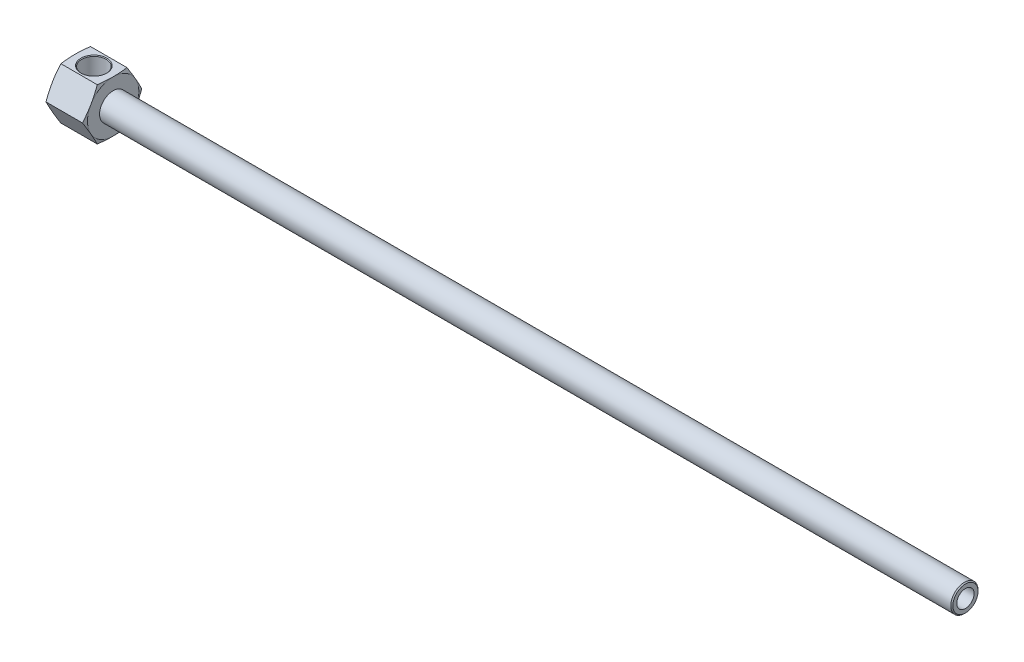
ISO-10303-21;
HEADER;
FILE_DESCRIPTION(('STEP AP214'),'2;1');
FILE_NAME('part.step','',(''),(''),'','','');
FILE_SCHEMA(('AUTOMOTIVE_DESIGN { 1 0 10303 214 1 1 1 1 }'));
ENDSEC;
DATA;
#1=APPLICATION_CONTEXT('core data for automotive mechanical design processes');
#2=APPLICATION_PROTOCOL_DEFINITION('international standard','automotive_design',2000,#1);
#3=PRODUCT_CONTEXT('',#1,'mechanical');
#4=PRODUCT('Part','Part','',(#3));
#5=PRODUCT_RELATED_PRODUCT_CATEGORY('part','',(#4));
#6=PRODUCT_DEFINITION_FORMATION('','',#4);
#7=PRODUCT_DEFINITION_CONTEXT('part definition',#1,'design');
#8=PRODUCT_DEFINITION('design','',#6,#7);
#9=PRODUCT_DEFINITION_SHAPE('','',#8);
#10=(LENGTH_UNIT() NAMED_UNIT(*) SI_UNIT(.MILLI.,.METRE.));
#11=(NAMED_UNIT(*) PLANE_ANGLE_UNIT() SI_UNIT($,.RADIAN.));
#12=(NAMED_UNIT(*) SI_UNIT($,.STERADIAN.) SOLID_ANGLE_UNIT());
#13=UNCERTAINTY_MEASURE_WITH_UNIT(LENGTH_MEASURE(1.E-05),#10,'distance_accuracy_value','');
#14=(GEOMETRIC_REPRESENTATION_CONTEXT(3) GLOBAL_UNCERTAINTY_ASSIGNED_CONTEXT((#13)) GLOBAL_UNIT_ASSIGNED_CONTEXT((#10,
#11,#12)) REPRESENTATION_CONTEXT('',''));
#15=CARTESIAN_POINT('',(0.,0.,0.));
#16=DIRECTION('',(0.,0.,1.));
#17=DIRECTION('',(1.,0.,0.));
#18=AXIS2_PLACEMENT_3D('',#15,#16,#17);
#19=CARTESIAN_POINT('',(0.,-9.525,9.63930330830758));
#20=DIRECTION('',(-1.,0.,0.));
#21=DIRECTION('',(0.,1.,0.));
#22=AXIS2_PLACEMENT_3D('',#19,#20,#21);
#23=PLANE('',#22);
#24=CARTESIAN_POINT('',(0.,0.,0.));
#25=DIRECTION('',(1.,0.,0.));
#26=DIRECTION('',(0.,0.,-1.));
#27=AXIS2_PLACEMENT_3D('',#24,#25,#26);
#28=CIRCLE('',#27,9.525);
#29=CARTESIAN_POINT('',(0.,4.7625,8.24889197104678));
#30=VERTEX_POINT('',#29);
#31=CARTESIAN_POINT('',(0.,-4.76249999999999,8.24889197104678));
#32=VERTEX_POINT('',#31);
#33=EDGE_CURVE('E127',#30,#32,#28,.T.);
#34=ORIENTED_EDGE('',*,*,#33,.F.);
#35=CARTESIAN_POINT('',(0.,0.,0.));
#36=DIRECTION('',(1.,0.,0.));
#37=DIRECTION('',(0.,0.,-1.));
#38=AXIS2_PLACEMENT_3D('',#35,#36,#37);
#39=CIRCLE('',#38,9.525);
#40=CARTESIAN_POINT('',(0.,9.525,0.));
#41=VERTEX_POINT('',#40);
#42=EDGE_CURVE('E124',#41,#30,#39,.T.);
#43=ORIENTED_EDGE('',*,*,#42,.F.);
#44=CARTESIAN_POINT('',(0.,0.,0.));
#45=DIRECTION('',(1.,0.,0.));
#46=DIRECTION('',(0.,0.,-1.));
#47=AXIS2_PLACEMENT_3D('',#44,#45,#46);
#48=CIRCLE('',#47,9.525);
#49=CARTESIAN_POINT('',(0.,4.7625,-8.24889197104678));
#50=VERTEX_POINT('',#49);
#51=EDGE_CURVE('E506',#50,#41,#48,.T.);
#52=ORIENTED_EDGE('',*,*,#51,.F.);
#53=CARTESIAN_POINT('',(0.,0.,0.));
#54=DIRECTION('',(1.,0.,0.));
#55=DIRECTION('',(0.,0.,-1.));
#56=AXIS2_PLACEMENT_3D('',#53,#54,#55);
#57=CIRCLE('',#56,9.525);
#58=CARTESIAN_POINT('',(0.,-4.7625,-8.24889197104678));
#59=VERTEX_POINT('',#58);
#60=EDGE_CURVE('E468',#59,#50,#57,.T.);
#61=ORIENTED_EDGE('',*,*,#60,.F.);
#62=CARTESIAN_POINT('',(0.,0.,0.));
#63=DIRECTION('',(1.,0.,0.));
#64=DIRECTION('',(0.,0.,-1.));
#65=AXIS2_PLACEMENT_3D('',#62,#63,#64);
#66=CIRCLE('',#65,9.525);
#67=CARTESIAN_POINT('',(0.,-9.525,0.));
#68=VERTEX_POINT('',#67);
#69=EDGE_CURVE('E507',#68,#59,#66,.T.);
#70=ORIENTED_EDGE('',*,*,#69,.F.);
#71=CARTESIAN_POINT('',(0.,0.,0.));
#72=DIRECTION('',(1.,0.,0.));
#73=DIRECTION('',(0.,0.,-1.));
#74=AXIS2_PLACEMENT_3D('',#71,#72,#73);
#75=CIRCLE('',#74,9.52499999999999);
#76=EDGE_CURVE('E130',#32,#68,#75,.T.);
#77=ORIENTED_EDGE('',*,*,#76,.F.);
#78=EDGE_LOOP('',(#34,#43,#52,#61,#70,#77));
#79=FACE_BOUND('',#78,.T.);
#80=ADVANCED_FACE('F33',(#79),#23,.T.);
#81=CARTESIAN_POINT('',(7.14502,0.,0.));
#82=DIRECTION('',(0.,1.,0.));
#83=DIRECTION('',(0.,0.,1.));
#84=AXIS2_PLACEMENT_3D('',#81,#82,#83);
#85=CYLINDRICAL_SURFACE('',#84,4.5466);
#86=CARTESIAN_POINT('',(7.14502,9.26719,0.));
#87=DIRECTION('',(0.,-1.,0.));
#88=DIRECTION('',(1.,0.,0.));
#89=AXIS2_PLACEMENT_3D('',#86,#87,#88);
#90=CIRCLE('',#89,4.5466);
#91=CARTESIAN_POINT('',(11.69162,9.26719,0.));
#92=VERTEX_POINT('',#91);
#93=EDGE_CURVE('E153',#92,#92,#90,.T.);
#94=ORIENTED_EDGE('',*,*,#93,.F.);
#95=EDGE_LOOP('',(#94));
#96=FACE_BOUND('',#95,.T.);
#97=CARTESIAN_POINT('',(7.14502,0.,0.));
#98=DIRECTION('',(0.,-1.,0.));
#99=DIRECTION('',(0.,0.,-1.));
#100=AXIS2_PLACEMENT_3D('',#97,#98,#99);
#101=CIRCLE('',#100,4.5466);
#102=CARTESIAN_POINT('',(10.3718988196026,0.,-3.20294));
#103=VERTEX_POINT('',#102);
#104=CARTESIAN_POINT('',(7.14502,0.,-4.5466));
#105=VERTEX_POINT('',#104);
#106=EDGE_CURVE('E383',#103,#105,#101,.F.);
#107=ORIENTED_EDGE('',*,*,#106,.F.);
#108=CARTESIAN_POINT('',(10.3718988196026,0.,3.20294));
#109=CARTESIAN_POINT('',(10.3718487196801,0.0773207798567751,3.20296218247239));
#110=CARTESIAN_POINT('',(10.3746766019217,0.154609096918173,3.20014120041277));
#111=CARTESIAN_POINT('',(10.3856998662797,0.308280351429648,3.18899270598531));
#112=CARTESIAN_POINT('',(10.3938865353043,0.384664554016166,3.18067413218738));
#113=CARTESIAN_POINT('',(10.4151226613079,0.535102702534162,3.15883115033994));
#114=CARTESIAN_POINT('',(10.4281171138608,0.609173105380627,3.14536557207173));
#115=CARTESIAN_POINT('',(10.4583563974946,0.755358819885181,3.11349624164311));
#116=CARTESIAN_POINT('',(10.475602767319,0.827473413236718,3.09509070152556));
#117=CARTESIAN_POINT('',(10.5324413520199,1.03937632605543,3.03316104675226));
#118=CARTESIAN_POINT('',(10.5773022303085,1.17579747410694,2.98276140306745));
#119=CARTESIAN_POINT('',(10.6758070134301,1.43826951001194,2.86548217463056));
#120=CARTESIAN_POINT('',(10.72947894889,1.56428530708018,2.79854963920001));
#121=CARTESIAN_POINT('',(10.8507656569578,1.82635647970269,2.63647300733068));
#122=CARTESIAN_POINT('',(10.9191692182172,1.96025733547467,2.53843455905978));
#123=CARTESIAN_POINT('',(11.0556156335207,2.21159066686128,2.32273637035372));
#124=CARTESIAN_POINT('',(11.1236583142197,2.32901581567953,2.20506795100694));
#125=CARTESIAN_POINT('',(11.2270559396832,2.50055973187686,2.00388469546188));
#126=CARTESIAN_POINT('',(11.2642714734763,2.56074695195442,1.92642462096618));
#127=CARTESIAN_POINT('',(11.3357984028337,2.67428971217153,1.76541634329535));
#128=CARTESIAN_POINT('',(11.370111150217,2.72764843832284,1.68187100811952));
#129=CARTESIAN_POINT('',(11.4348567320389,2.82690007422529,1.50909897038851));
#130=CARTESIAN_POINT('',(11.4652918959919,2.87279747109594,1.41987572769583));
#131=CARTESIAN_POINT('',(11.5213701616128,2.95646041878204,1.23625887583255));
#132=CARTESIAN_POINT('',(11.5470145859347,2.9942282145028,1.14186670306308));
#133=CARTESIAN_POINT('',(11.5893487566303,3.05609920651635,0.962665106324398));
#134=CARTESIAN_POINT('',(11.6067971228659,3.08138856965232,0.87844341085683));
#135=CARTESIAN_POINT('',(11.6370851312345,3.12508413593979,0.707430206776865));
#136=CARTESIAN_POINT('',(11.6499258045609,3.14349187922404,0.620639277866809));
#137=CARTESIAN_POINT('',(11.6706171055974,3.17307325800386,0.445336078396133));
#138=CARTESIAN_POINT('',(11.6784728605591,3.18425432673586,0.356825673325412));
#139=CARTESIAN_POINT('',(11.6889738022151,3.19918706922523,0.178874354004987));
#140=CARTESIAN_POINT('',(11.6916195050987,3.2029394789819,0.0894335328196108));
#141=CARTESIAN_POINT('',(11.6916204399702,3.20294046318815,-0.0795069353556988));
#142=CARTESIAN_POINT('',(11.6895302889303,3.19997569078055,-0.159008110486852));
#143=CARTESIAN_POINT('',(11.6812221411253,3.18816571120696,-0.317382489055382));
#144=CARTESIAN_POINT('',(11.675002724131,3.17931848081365,-0.396255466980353));
#145=CARTESIAN_POINT('',(11.6585849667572,3.15588216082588,-0.552707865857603));
#146=CARTESIAN_POINT('',(11.6483873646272,3.14129413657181,-0.630287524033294));
#147=CARTESIAN_POINT('',(11.6242551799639,3.10659837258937,-0.783621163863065));
#148=CARTESIAN_POINT('',(11.6103189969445,3.08648826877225,-0.859374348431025));
#149=CARTESIAN_POINT('',(11.5635078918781,3.01850709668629,-1.08233183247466));
#150=CARTESIAN_POINT('',(11.5255257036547,2.96283923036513,-1.22617939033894));
#151=CARTESIAN_POINT('',(11.4389016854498,2.83319466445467,-1.5016933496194));
#152=CARTESIAN_POINT('',(11.3902583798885,2.75921543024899,-1.63335806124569));
#153=CARTESIAN_POINT('',(11.2809206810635,2.58798363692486,-1.89409657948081));
#154=CARTESIAN_POINT('',(11.2195398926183,2.4892482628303,-2.02190335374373));
#155=CARTESIAN_POINT('',(11.0922716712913,2.27497585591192,-2.26032355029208));
#156=CARTESIAN_POINT('',(11.0263775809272,2.15941370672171,-2.37091075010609));
#157=CARTESIAN_POINT('',(10.9219405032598,1.96370296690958,-2.53209942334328));
#158=CARTESIAN_POINT('',(10.8832704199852,1.88848318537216,-2.58869375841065));
#159=CARTESIAN_POINT('',(10.8071515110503,1.73293436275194,-2.69530411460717));
#160=CARTESIAN_POINT('',(10.7697030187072,1.65260394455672,-2.74531835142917));
#161=CARTESIAN_POINT('',(10.6610838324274,1.40433111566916,-2.88490294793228));
#162=CARTESIAN_POINT('',(10.5934398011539,1.22875329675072,-2.96430850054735));
#163=CARTESIAN_POINT('',(10.4974392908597,0.916817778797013,-3.0718737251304));
#164=CARTESIAN_POINT('',(10.4634005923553,0.785075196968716,-3.10828568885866));
#165=CARTESIAN_POINT('',(10.4234508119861,0.582870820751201,-3.15020980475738));
#166=CARTESIAN_POINT('',(10.411992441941,0.514785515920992,-3.1620624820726));
#167=CARTESIAN_POINT('',(10.3931893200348,0.37745017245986,-3.1813761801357));
#168=CARTESIAN_POINT('',(10.3858421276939,0.308200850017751,-3.18883980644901));
#169=CARTESIAN_POINT('',(10.3777873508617,0.199006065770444,-3.19699901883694));
#170=CARTESIAN_POINT('',(10.3755831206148,0.159274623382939,-3.19922495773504));
#171=CARTESIAN_POINT('',(10.3726373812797,0.0796976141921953,-3.20219604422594));
#172=CARTESIAN_POINT('',(10.371896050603,0.0398520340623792,-3.20294101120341));
#173=CARTESIAN_POINT('',(10.3718988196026,0.,-3.20294));
#174=B_SPLINE_CURVE_WITH_KNOTS('',3,(#108,#109,#110,#111,#112,#113,#114,#115,#116,#117,#118,
#119,#120,#121,#122,#123,#124,#125,#126,#127,#128,#129,#130,#131,#132,#133,#134,#135,#136,#137,
#138,#139,#140,#141,#142,#143,#144,#145,#146,#147,#148,#149,#150,#151,#152,#153,#154,#155,#156,
#157,#158,#159,#160,#161,#162,#163,#164,#165,#166,#167,#168,#169,#170,#171,#172,#173),
.UNSPECIFIED.,.F.,.F.,(4,2,2,2,2,2,2,2,2,2,2,2,2,2,2,2,2,2,2,2,2,2,2,2,2,2,2,2,2,2,2,2,4),(0.,
0.231807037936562,0.463238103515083,0.692099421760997,0.921043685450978,1.37567767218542,
1.83178705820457,2.36841073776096,2.90527230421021,3.21964895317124,3.53387838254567,
3.84791813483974,4.16187105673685,4.43043111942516,4.69893104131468,4.96715434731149,
5.23535107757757,5.47377954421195,5.71229005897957,5.95075633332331,6.18932485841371,
6.66361258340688,7.13796599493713,7.65441871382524,8.17165036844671,8.4766222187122,
8.78167659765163,9.39029977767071,9.811124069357,10.0210520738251,10.2308553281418,
10.3503705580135,10.4699003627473),.UNSPECIFIED.);
#175=CARTESIAN_POINT('',(10.3718988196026,0.,3.20294));
#176=VERTEX_POINT('',#175);
#177=EDGE_CURVE('E422',#176,#103,#174,.T.);
#178=ORIENTED_EDGE('',*,*,#177,.F.);
#179=CARTESIAN_POINT('',(7.14502,0.,0.));
#180=DIRECTION('',(0.,-1.,0.));
#181=DIRECTION('',(0.,0.,-1.));
#182=AXIS2_PLACEMENT_3D('',#179,#180,#181);
#183=CIRCLE('',#182,4.5466);
#184=CARTESIAN_POINT('',(7.14502,0.,4.5466));
#185=VERTEX_POINT('',#184);
#186=EDGE_CURVE('E379',#185,#176,#183,.F.);
#187=ORIENTED_EDGE('',*,*,#186,.F.);
#188=CARTESIAN_POINT('',(7.14502,0.,0.));
#189=DIRECTION('',(0.,1.,0.));
#190=DIRECTION('',(0.,0.,-1.));
#191=AXIS2_PLACEMENT_3D('',#188,#189,#190);
#192=CIRCLE('',#191,4.5466);
#193=EDGE_CURVE('E380',#105,#185,#192,.T.);
#194=ORIENTED_EDGE('',*,*,#193,.F.);
#195=EDGE_LOOP('',(#107,#178,#187,#194));
#196=FACE_BOUND('',#195,.T.);
#197=ADVANCED_FACE('F419',(#96,#196),#85,.F.);
#198=CARTESIAN_POINT('',(7.14502,0.,0.));
#199=DIRECTION('',(0.,0.,1.));
#200=DIRECTION('',(-1.,0.,0.));
#201=AXIS2_PLACEMENT_3D('',#198,#199,#200);
#202=SPHERICAL_SURFACE('',#201,4.5466);
#203=ORIENTED_EDGE('',*,*,#193,.T.);
#204=ORIENTED_EDGE('',*,*,#186,.T.);
#205=CARTESIAN_POINT('',(10.3718988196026,0.,0.));
#206=DIRECTION('',(-1.,0.,0.));
#207=DIRECTION('',(0.,0.,1.));
#208=AXIS2_PLACEMENT_3D('',#205,#206,#207);
#209=CIRCLE('',#208,3.20294);
#210=EDGE_CURVE('E428',#103,#176,#209,.T.);
#211=ORIENTED_EDGE('',*,*,#210,.F.);
#212=ORIENTED_EDGE('',*,*,#106,.T.);
#213=EDGE_LOOP('',(#203,#204,#211,#212));
#214=FACE_BOUND('',#213,.T.);
#215=ADVANCED_FACE('F427',(#214),#202,.F.);
#216=CARTESIAN_POINT('',(7.14502,9.525,0.));
#217=DIRECTION('',(0.,1.,0.));
#218=DIRECTION('',(0.,0.,1.));
#219=AXIS2_PLACEMENT_3D('',#216,#217,#218);
#220=CONICAL_SURFACE('',#219,4.80441,0.785398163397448);
#221=CARTESIAN_POINT('',(7.14502,9.525,0.));
#222=DIRECTION('',(0.,1.,0.));
#223=DIRECTION('',(0.,0.,1.));
#224=AXIS2_PLACEMENT_3D('',#221,#222,#223);
#225=CIRCLE('',#224,4.80441);
#226=CARTESIAN_POINT('',(7.14502,9.525,4.80441));
#227=VERTEX_POINT('',#226);
#228=EDGE_CURVE('E143',#227,#227,#225,.F.);
#229=ORIENTED_EDGE('',*,*,#228,.F.);
#230=EDGE_LOOP('',(#229));
#231=FACE_BOUND('',#230,.T.);
#232=ORIENTED_EDGE('',*,*,#93,.T.);
#233=EDGE_LOOP('',(#232));
#234=FACE_BOUND('',#233,.T.);
#235=ADVANCED_FACE('F183',(#231,#234),#220,.F.);
#236=CARTESIAN_POINT('',(0.,0.,0.));
#237=DIRECTION('',(1.,0.,0.));
#238=DIRECTION('',(0.,0.,-1.));
#239=AXIS2_PLACEMENT_3D('',#236,#237,#238);
#240=CONICAL_SURFACE('',#239,9.525,1.30899693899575);
#241=CARTESIAN_POINT('',(0.,9.525,0.));
#242=CARTESIAN_POINT('',(-1.30949964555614E-05,9.525,0.230065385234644));
#243=CARTESIAN_POINT('',(0.00223320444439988,9.525,0.460128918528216));
#244=CARTESIAN_POINT('',(0.011148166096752,9.525,0.920163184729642));
#245=CARTESIAN_POINT('',(0.0178166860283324,9.525,1.15013392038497));
#246=CARTESIAN_POINT('',(0.0354697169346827,9.525,1.60964911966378));
#247=CARTESIAN_POINT('',(0.0464493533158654,9.525,1.83919377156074));
#248=CARTESIAN_POINT('',(0.072542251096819,9.525,2.29804695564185));
#249=CARTESIAN_POINT('',(0.0876555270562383,9.525,2.52735548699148));
#250=CARTESIAN_POINT('',(0.138860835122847,9.525,3.21471802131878));
#251=CARTESIAN_POINT('',(0.180823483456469,9.525,3.6723366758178));
#252=CARTESIAN_POINT('',(0.278248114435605,9.525,4.58667279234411));
#253=CARTESIAN_POINT('',(0.333725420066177,9.525,5.04338863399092));
#254=CARTESIAN_POINT('',(0.394829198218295,9.525,5.49926131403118));
#255=B_SPLINE_CURVE_WITH_KNOTS('',3,(#241,#242,#243,#244,#245,#246,#247,#248,#249,#250,#251,
#252,#253,#254),.UNSPECIFIED.,.F.,.F.,(4,2,2,2,2,2,4),(0.,0.690182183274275,1.38034216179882,
2.06972401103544,2.75910828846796,4.13749362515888,5.51744911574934),.UNSPECIFIED.);
#256=CARTESIAN_POINT('',(0.394829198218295,9.525,5.49926131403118));
#257=VERTEX_POINT('',#256);
#258=EDGE_CURVE('E151',#41,#257,#255,.T.);
#259=ORIENTED_EDGE('',*,*,#258,.F.);
#260=ORIENTED_EDGE('',*,*,#42,.T.);
#261=CARTESIAN_POINT('',(0.394829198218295,9.525,5.49926131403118));
#262=CARTESIAN_POINT('',(0.333725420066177,9.13020267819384,5.72719765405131));
#263=CARTESIAN_POINT('',(0.278248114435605,8.7346751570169,5.95555557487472));
#264=CARTESIAN_POINT('',(0.180823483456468,7.94283685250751,6.41272363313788));
#265=CARTESIAN_POINT('',(0.138860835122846,7.54652747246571,6.64153296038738));
#266=CARTESIAN_POINT('',(0.0876555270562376,6.95125405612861,6.98521422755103));
#267=CARTESIAN_POINT('',(0.0725422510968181,6.75266704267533,7.09986849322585));
#268=CARTESIAN_POINT('',(0.0464493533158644,6.35528852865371,7.32929508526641));
#269=CARTESIAN_POINT('',(0.0354697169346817,6.15649702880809,7.44406741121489));
#270=CARTESIAN_POINT('',(0.0178166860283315,5.75854519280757,7.67382501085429));
#271=CARTESIAN_POINT('',(0.0111481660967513,5.55938469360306,7.78881037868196));
#272=CARTESIAN_POINT('',(0.00223320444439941,5.16098333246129,8.01882751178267));
#273=CARTESIAN_POINT('',(-1.30949964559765E-05,4.96174246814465,8.13385927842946));
#274=CARTESIAN_POINT('',(0.,4.76249999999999,8.24889197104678));
#275=B_SPLINE_CURVE_WITH_KNOTS('',3,(#261,#262,#263,#264,#265,#266,#267,#268,#269,#270,#271,
#272,#273,#274),.UNSPECIFIED.,.F.,.F.,(4,2,2,2,2,2,4),(0.,1.37995549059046,2.75834082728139,
3.44772510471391,4.13710695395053,4.82726693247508,5.51744911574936),.UNSPECIFIED.);
#276=EDGE_CURVE('E149',#257,#30,#275,.T.);
#277=ORIENTED_EDGE('',*,*,#276,.F.);
#278=EDGE_LOOP('',(#259,#260,#277));
#279=FACE_BOUND('',#278,.T.);
#280=ADVANCED_FACE('F148',(#279),#240,.T.);
#281=CARTESIAN_POINT('',(0.,0.,0.));
#282=DIRECTION('',(1.,0.,0.));
#283=DIRECTION('',(0.,0.,-1.));
#284=AXIS2_PLACEMENT_3D('',#281,#282,#283);
#285=CONICAL_SURFACE('',#284,9.525,1.30899693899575);
#286=CARTESIAN_POINT('',(0.,4.76249999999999,8.24889197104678));
#287=CARTESIAN_POINT('',(-1.30949964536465E-05,4.56325753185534,8.3639246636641));
#288=CARTESIAN_POINT('',(0.00223320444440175,4.3640166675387,8.47895643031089));
#289=CARTESIAN_POINT('',(0.0111481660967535,3.96561530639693,8.7089735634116));
#290=CARTESIAN_POINT('',(0.0178166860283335,3.76645480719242,8.82395893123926));
#291=CARTESIAN_POINT('',(0.0354697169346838,3.3685029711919,9.05371653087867));
#292=CARTESIAN_POINT('',(0.0464493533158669,3.16971147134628,9.16848885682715));
#293=CARTESIAN_POINT('',(0.0725422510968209,2.77233295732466,9.39791544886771));
#294=CARTESIAN_POINT('',(0.0876555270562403,2.57374594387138,9.51256971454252));
#295=CARTESIAN_POINT('',(0.138860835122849,1.97847252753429,9.85625098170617));
#296=CARTESIAN_POINT('',(0.180823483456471,1.58216314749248,10.0850603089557));
#297=CARTESIAN_POINT('',(0.278248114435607,0.790324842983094,10.5422283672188));
#298=CARTESIAN_POINT('',(0.33372542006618,0.39479732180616,10.7705862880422));
#299=CARTESIAN_POINT('',(0.394829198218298,0.,10.9985226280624));
#300=B_SPLINE_CURVE_WITH_KNOTS('',3,(#286,#287,#288,#289,#290,#291,#292,#293,#294,#295,#296,
#297,#298,#299),.UNSPECIFIED.,.F.,.F.,(4,2,2,2,2,2,4),(0.,0.690182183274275,1.38034216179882,
2.06972401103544,2.75910828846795,4.13749362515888,5.51744911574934),.UNSPECIFIED.);
#301=CARTESIAN_POINT('',(0.394829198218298,0.,10.9985226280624));
#302=VERTEX_POINT('',#301);
#303=EDGE_CURVE('E136',#30,#302,#300,.T.);
#304=ORIENTED_EDGE('',*,*,#303,.F.);
#305=ORIENTED_EDGE('',*,*,#33,.T.);
#306=CARTESIAN_POINT('',(0.394829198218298,0.,10.9985226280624));
#307=CARTESIAN_POINT('',(0.33372542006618,-0.394797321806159,10.7705862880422));
#308=CARTESIAN_POINT('',(0.278248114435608,-0.790324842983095,10.5422283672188));
#309=CARTESIAN_POINT('',(0.180823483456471,-1.58216314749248,10.0850603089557));
#310=CARTESIAN_POINT('',(0.138860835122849,-1.97847252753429,9.85625098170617));
#311=CARTESIAN_POINT('',(0.0876555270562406,-2.57374594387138,9.51256971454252));
#312=CARTESIAN_POINT('',(0.0725422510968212,-2.77233295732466,9.39791544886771));
#313=CARTESIAN_POINT('',(0.0464493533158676,-3.16971147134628,9.16848885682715));
#314=CARTESIAN_POINT('',(0.0354697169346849,-3.3685029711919,9.05371653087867));
#315=CARTESIAN_POINT('',(0.0178166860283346,-3.76645480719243,8.82395893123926));
#316=CARTESIAN_POINT('',(0.0111481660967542,-3.96561530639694,8.7089735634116));
#317=CARTESIAN_POINT('',(0.00223320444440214,-4.3640166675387,8.47895643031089));
#318=CARTESIAN_POINT('',(-1.30949964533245E-05,-4.56325753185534,8.3639246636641));
#319=CARTESIAN_POINT('',(0.,-4.7625,8.24889197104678));
#320=B_SPLINE_CURVE_WITH_KNOTS('',3,(#306,#307,#308,#309,#310,#311,#312,#313,#314,#315,#316,
#317,#318,#319),.UNSPECIFIED.,.F.,.F.,(4,2,2,2,2,2,4),(0.,1.37995549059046,2.75834082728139,
3.44772510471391,4.13710695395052,4.82726693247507,5.51744911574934),.UNSPECIFIED.);
#321=EDGE_CURVE('E138',#302,#32,#320,.T.);
#322=ORIENTED_EDGE('',*,*,#321,.F.);
#323=EDGE_LOOP('',(#304,#305,#322));
#324=FACE_BOUND('',#323,.T.);
#325=ADVANCED_FACE('F137',(#324),#285,.T.);
#326=CARTESIAN_POINT('',(0.,0.,0.));
#327=DIRECTION('',(1.,0.,0.));
#328=DIRECTION('',(0.,0.,-1.));
#329=AXIS2_PLACEMENT_3D('',#326,#327,#328);
#330=CONICAL_SURFACE('',#329,9.525,1.30899693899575);
#331=CARTESIAN_POINT('',(0.,-4.7625,8.24889197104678));
#332=CARTESIAN_POINT('',(-1.30949964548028E-05,-4.96174246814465,8.13385927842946));
#333=CARTESIAN_POINT('',(0.00223320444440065,-5.16098333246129,8.01882751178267));
#334=CARTESIAN_POINT('',(0.0111481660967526,-5.55938469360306,7.78881037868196));
#335=CARTESIAN_POINT('',(0.0178166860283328,-5.75854519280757,7.6738250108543));
#336=CARTESIAN_POINT('',(0.0354697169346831,-6.15649702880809,7.44406741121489));
#337=CARTESIAN_POINT('',(0.046449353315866,-6.35528852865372,7.32929508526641));
#338=CARTESIAN_POINT('',(0.0725422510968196,-6.75266704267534,7.09986849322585));
#339=CARTESIAN_POINT('',(0.0876555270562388,-6.95125405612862,6.98521422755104));
#340=CARTESIAN_POINT('',(0.138860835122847,-7.54652747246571,6.64153296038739));
#341=CARTESIAN_POINT('',(0.18082348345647,-7.94283685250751,6.41272363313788));
#342=CARTESIAN_POINT('',(0.278248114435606,-8.73467515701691,5.95555557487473));
#343=CARTESIAN_POINT('',(0.333725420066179,-9.13020267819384,5.72719765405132));
#344=CARTESIAN_POINT('',(0.394829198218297,-9.525,5.49926131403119));
#345=B_SPLINE_CURVE_WITH_KNOTS('',3,(#331,#332,#333,#334,#335,#336,#337,#338,#339,#340,#341,
#342,#343,#344),.UNSPECIFIED.,.F.,.F.,(4,2,2,2,2,2,4),(0.,0.690182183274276,1.38034216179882,
2.06972401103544,2.75910828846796,4.13749362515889,5.51744911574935),.UNSPECIFIED.);
#346=CARTESIAN_POINT('',(0.394829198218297,-9.525,5.49926131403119));
#347=VERTEX_POINT('',#346);
#348=EDGE_CURVE('E157',#32,#347,#345,.T.);
#349=ORIENTED_EDGE('',*,*,#348,.F.);
#350=ORIENTED_EDGE('',*,*,#76,.T.);
#351=CARTESIAN_POINT('',(0.394829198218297,-9.525,5.49926131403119));
#352=CARTESIAN_POINT('',(0.333725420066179,-9.525,5.04338863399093));
#353=CARTESIAN_POINT('',(0.278248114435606,-9.525,4.58667279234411));
#354=CARTESIAN_POINT('',(0.18082348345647,-9.525,3.67233667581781));
#355=CARTESIAN_POINT('',(0.138860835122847,-9.525,3.21471802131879));
#356=CARTESIAN_POINT('',(0.0876555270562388,-9.525,2.52735548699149));
#357=CARTESIAN_POINT('',(0.0725422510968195,-9.525,2.29804695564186));
#358=CARTESIAN_POINT('',(0.0464493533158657,-9.525,1.83919377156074));
#359=CARTESIAN_POINT('',(0.0354697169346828,-9.525,1.60964911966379));
#360=CARTESIAN_POINT('',(0.0178166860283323,-9.525,1.15013392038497));
#361=CARTESIAN_POINT('',(0.0111481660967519,-9.525,0.920163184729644));
#362=CARTESIAN_POINT('',(0.00223320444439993,-9.525,0.460128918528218));
#363=CARTESIAN_POINT('',(-1.30949964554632E-05,-9.525,0.230065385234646));
#364=CARTESIAN_POINT('',(0.,-9.525,0.));
#365=B_SPLINE_CURVE_WITH_KNOTS('',3,(#351,#352,#353,#354,#355,#356,#357,#358,#359,#360,#361,
#362,#363,#364),.UNSPECIFIED.,.F.,.F.,(4,2,2,2,2,2,4),(0.,1.37995549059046,2.75834082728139,
3.44772510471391,4.13710695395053,4.82726693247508,5.51744911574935),.UNSPECIFIED.);
#366=EDGE_CURVE('E346',#347,#68,#365,.T.);
#367=ORIENTED_EDGE('',*,*,#366,.F.);
#368=EDGE_LOOP('',(#349,#350,#367));
#369=FACE_BOUND('',#368,.T.);
#370=ADVANCED_FACE('F512',(#369),#330,.T.);
#371=CARTESIAN_POINT('',(0.,0.,0.));
#372=DIRECTION('',(1.,0.,0.));
#373=DIRECTION('',(0.,0.,-1.));
#374=AXIS2_PLACEMENT_3D('',#371,#372,#373);
#375=CONICAL_SURFACE('',#374,9.525,1.30899693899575);
#376=ORIENTED_EDGE('',*,*,#51,.T.);
#377=CARTESIAN_POINT('',(0.394829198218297,9.525,-5.49926131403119));
#378=CARTESIAN_POINT('',(0.333725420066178,9.525,-5.04338863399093));
#379=CARTESIAN_POINT('',(0.278248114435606,9.525,-4.58667279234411));
#380=CARTESIAN_POINT('',(0.18082348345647,9.525,-3.67233667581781));
#381=CARTESIAN_POINT('',(0.138860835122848,9.525,-3.21471802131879));
#382=CARTESIAN_POINT('',(0.0876555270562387,9.525,-2.52735548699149));
#383=CARTESIAN_POINT('',(0.0725422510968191,9.525,-2.29804695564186));
#384=CARTESIAN_POINT('',(0.0464493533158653,9.525,-1.83919377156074));
#385=CARTESIAN_POINT('',(0.0354697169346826,9.525,-1.60964911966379));
#386=CARTESIAN_POINT('',(0.0178166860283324,9.525,-1.15013392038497));
#387=CARTESIAN_POINT('',(0.011148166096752,9.525,-0.920163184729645));
#388=CARTESIAN_POINT('',(0.00223320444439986,9.525,-0.460128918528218));
#389=CARTESIAN_POINT('',(-1.30949964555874E-05,9.525,-0.230065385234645));
#390=CARTESIAN_POINT('',(0.,9.525,0.));
#391=B_SPLINE_CURVE_WITH_KNOTS('',3,(#377,#378,#379,#380,#381,#382,#383,#384,#385,#386,#387,
#388,#389,#390),.UNSPECIFIED.,.F.,.F.,(4,2,2,2,2,2,4),(0.,1.37995549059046,2.75834082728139,
3.44772510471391,4.13710695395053,4.82726693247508,5.51744911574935),.UNSPECIFIED.);
#392=CARTESIAN_POINT('',(0.394829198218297,9.525,-5.49926131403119));
#393=VERTEX_POINT('',#392);
#394=EDGE_CURVE('E192',#393,#41,#391,.T.);
#395=ORIENTED_EDGE('',*,*,#394,.F.);
#396=CARTESIAN_POINT('',(0.,4.7625,-8.24889197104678));
#397=CARTESIAN_POINT('',(-1.30949964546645E-05,4.96174246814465,-8.13385927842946));
#398=CARTESIAN_POINT('',(0.0022332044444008,5.1609833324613,-8.01882751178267));
#399=CARTESIAN_POINT('',(0.0111481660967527,5.55938469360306,-7.78881037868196));
#400=CARTESIAN_POINT('',(0.0178166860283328,5.75854519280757,-7.6738250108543));
#401=CARTESIAN_POINT('',(0.0354697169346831,6.1564970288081,-7.44406741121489));
#402=CARTESIAN_POINT('',(0.0464493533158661,6.35528852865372,-7.32929508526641));
#403=CARTESIAN_POINT('',(0.07254225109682,6.75266704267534,-7.09986849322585));
#404=CARTESIAN_POINT('',(0.0876555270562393,6.95125405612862,-6.98521422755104));
#405=CARTESIAN_POINT('',(0.138860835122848,7.54652747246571,-6.64153296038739));
#406=CARTESIAN_POINT('',(0.18082348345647,7.94283685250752,-6.41272363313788));
#407=CARTESIAN_POINT('',(0.278248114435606,8.73467515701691,-5.95555557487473));
#408=CARTESIAN_POINT('',(0.333725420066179,9.13020267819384,-5.72719765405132));
#409=CARTESIAN_POINT('',(0.394829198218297,9.525,-5.49926131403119));
#410=B_SPLINE_CURVE_WITH_KNOTS('',3,(#396,#397,#398,#399,#400,#401,#402,#403,#404,#405,#406,
#407,#408,#409),.UNSPECIFIED.,.F.,.F.,(4,2,2,2,2,2,4),(0.,0.690182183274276,1.38034216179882,
2.06972401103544,2.75910828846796,4.13749362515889,5.51744911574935),.UNSPECIFIED.);
#411=EDGE_CURVE('E333',#50,#393,#410,.T.);
#412=ORIENTED_EDGE('',*,*,#411,.F.);
#413=EDGE_LOOP('',(#376,#395,#412));
#414=FACE_BOUND('',#413,.T.);
#415=ADVANCED_FACE('F510',(#414),#375,.T.);
#416=CARTESIAN_POINT('',(0.,0.,0.));
#417=DIRECTION('',(1.,0.,0.));
#418=DIRECTION('',(0.,0.,-1.));
#419=AXIS2_PLACEMENT_3D('',#416,#417,#418);
#420=CONICAL_SURFACE('',#419,9.525,1.30899693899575);
#421=ORIENTED_EDGE('',*,*,#69,.T.);
#422=CARTESIAN_POINT('',(0.394829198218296,-9.525,-5.49926131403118));
#423=CARTESIAN_POINT('',(0.333725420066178,-9.13020267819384,-5.72719765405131));
#424=CARTESIAN_POINT('',(0.278248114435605,-8.73467515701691,-5.95555557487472));
#425=CARTESIAN_POINT('',(0.180823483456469,-7.94283685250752,-6.41272363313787));
#426=CARTESIAN_POINT('',(0.138860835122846,-7.54652747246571,-6.64153296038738));
#427=CARTESIAN_POINT('',(0.087655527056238,-6.95125405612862,-6.98521422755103));
#428=CARTESIAN_POINT('',(0.0725422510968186,-6.75266704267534,-7.09986849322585));
#429=CARTESIAN_POINT('',(0.046449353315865,-6.35528852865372,-7.3292950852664));
#430=CARTESIAN_POINT('',(0.0354697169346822,-6.1564970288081,-7.44406741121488));
#431=CARTESIAN_POINT('',(0.0178166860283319,-5.75854519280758,-7.67382501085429));
#432=CARTESIAN_POINT('',(0.0111481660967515,-5.55938469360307,-7.78881037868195));
#433=CARTESIAN_POINT('',(0.00223320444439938,-5.1609833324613,-8.01882751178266));
#434=CARTESIAN_POINT('',(-1.30949964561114E-05,-4.96174246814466,-8.13385927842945));
#435=CARTESIAN_POINT('',(0.,-4.7625,-8.24889197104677));
#436=B_SPLINE_CURVE_WITH_KNOTS('',3,(#422,#423,#424,#425,#426,#427,#428,#429,#430,#431,#432,
#433,#434,#435),.UNSPECIFIED.,.F.,.F.,(4,2,2,2,2,2,4),(0.,1.37995549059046,2.75834082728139,
3.44772510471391,4.13710695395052,4.82726693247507,5.51744911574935),.UNSPECIFIED.);
#437=CARTESIAN_POINT('',(0.394829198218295,-9.525,-5.49926131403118));
#438=VERTEX_POINT('',#437);
#439=EDGE_CURVE('E364',#438,#59,#436,.T.);
#440=ORIENTED_EDGE('',*,*,#439,.F.);
#441=CARTESIAN_POINT('',(0.,-9.525,0.));
#442=CARTESIAN_POINT('',(-1.30949964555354E-05,-9.525,-0.230065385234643));
#443=CARTESIAN_POINT('',(0.00223320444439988,-9.525,-0.460128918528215));
#444=CARTESIAN_POINT('',(0.011148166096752,-9.525,-0.920163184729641));
#445=CARTESIAN_POINT('',(0.0178166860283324,-9.525,-1.15013392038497));
#446=CARTESIAN_POINT('',(0.0354697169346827,-9.525,-1.60964911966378));
#447=CARTESIAN_POINT('',(0.0464493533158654,-9.525,-1.83919377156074));
#448=CARTESIAN_POINT('',(0.072542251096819,-9.525,-2.29804695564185));
#449=CARTESIAN_POINT('',(0.0876555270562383,-9.525,-2.52735548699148));
#450=CARTESIAN_POINT('',(0.138860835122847,-9.525,-3.21471802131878));
#451=CARTESIAN_POINT('',(0.180823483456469,-9.525,-3.6723366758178));
#452=CARTESIAN_POINT('',(0.278248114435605,-9.525,-4.5866727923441));
#453=CARTESIAN_POINT('',(0.333725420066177,-9.525,-5.04338863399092));
#454=CARTESIAN_POINT('',(0.394829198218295,-9.525,-5.49926131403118));
#455=B_SPLINE_CURVE_WITH_KNOTS('',3,(#441,#442,#443,#444,#445,#446,#447,#448,#449,#450,#451,
#452,#453,#454),.UNSPECIFIED.,.F.,.F.,(4,2,2,2,2,2,4),(0.,0.690182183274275,1.38034216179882,
2.06972401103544,2.75910828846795,4.13749362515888,5.51744911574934),.UNSPECIFIED.);
#456=EDGE_CURVE('E443',#68,#438,#455,.T.);
#457=ORIENTED_EDGE('',*,*,#456,.F.);
#458=EDGE_LOOP('',(#421,#440,#457));
#459=FACE_BOUND('',#458,.T.);
#460=ADVANCED_FACE('F354',(#459),#420,.T.);
#461=CARTESIAN_POINT('',(0.,0.,0.));
#462=DIRECTION('',(1.,0.,0.));
#463=DIRECTION('',(0.,0.,-1.));
#464=AXIS2_PLACEMENT_3D('',#461,#462,#463);
#465=CONICAL_SURFACE('',#464,9.525,1.30899693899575);
#466=ORIENTED_EDGE('',*,*,#60,.T.);
#467=CARTESIAN_POINT('',(0.394829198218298,0.,-10.9985226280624));
#468=CARTESIAN_POINT('',(0.33372542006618,0.394797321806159,-10.7705862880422));
#469=CARTESIAN_POINT('',(0.278248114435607,0.790324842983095,-10.5422283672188));
#470=CARTESIAN_POINT('',(0.180823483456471,1.58216314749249,-10.0850603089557));
#471=CARTESIAN_POINT('',(0.138860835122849,1.97847252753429,-9.85625098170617));
#472=CARTESIAN_POINT('',(0.0876555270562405,2.57374594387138,-9.51256971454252));
#473=CARTESIAN_POINT('',(0.0725422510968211,2.77233295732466,-9.39791544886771));
#474=CARTESIAN_POINT('',(0.0464493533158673,3.16971147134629,-9.16848885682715));
#475=CARTESIAN_POINT('',(0.0354697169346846,3.36850297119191,-9.05371653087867));
#476=CARTESIAN_POINT('',(0.0178166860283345,3.76645480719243,-8.82395893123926));
#477=CARTESIAN_POINT('',(0.0111481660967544,3.96561530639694,-8.7089735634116));
#478=CARTESIAN_POINT('',(0.00223320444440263,4.36401666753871,-8.47895643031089));
#479=CARTESIAN_POINT('',(-1.30949964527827E-05,4.56325753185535,-8.3639246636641));
#480=CARTESIAN_POINT('',(0.,4.7625,-8.24889197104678));
#481=B_SPLINE_CURVE_WITH_KNOTS('',3,(#467,#468,#469,#470,#471,#472,#473,#474,#475,#476,#477,
#478,#479,#480),.UNSPECIFIED.,.F.,.F.,(4,2,2,2,2,2,4),(0.,1.37995549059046,2.75834082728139,
3.44772510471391,4.13710695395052,4.82726693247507,5.51744911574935),.UNSPECIFIED.);
#482=CARTESIAN_POINT('',(0.394829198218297,0.,-10.9985226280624));
#483=VERTEX_POINT('',#482);
#484=EDGE_CURVE('E340',#483,#50,#481,.T.);
#485=ORIENTED_EDGE('',*,*,#484,.F.);
#486=CARTESIAN_POINT('',(0.,-4.7625,-8.24889197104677));
#487=CARTESIAN_POINT('',(-1.30949964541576E-05,-4.56325753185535,-8.3639246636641));
#488=CARTESIAN_POINT('',(0.00223320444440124,-4.36401666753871,-8.47895643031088));
#489=CARTESIAN_POINT('',(0.0111481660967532,-3.96561530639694,-8.7089735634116));
#490=CARTESIAN_POINT('',(0.0178166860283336,-3.76645480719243,-8.82395893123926));
#491=CARTESIAN_POINT('',(0.0354697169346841,-3.36850297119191,-9.05371653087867));
#492=CARTESIAN_POINT('',(0.046449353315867,-3.16971147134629,-9.16848885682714));
#493=CARTESIAN_POINT('',(0.0725422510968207,-2.77233295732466,-9.3979154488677));
#494=CARTESIAN_POINT('',(0.0876555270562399,-2.57374594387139,-9.51256971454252));
#495=CARTESIAN_POINT('',(0.138860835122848,-1.97847252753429,-9.85625098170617));
#496=CARTESIAN_POINT('',(0.18082348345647,-1.58216314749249,-10.0850603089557));
#497=CARTESIAN_POINT('',(0.278248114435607,-0.790324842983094,-10.5422283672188));
#498=CARTESIAN_POINT('',(0.33372542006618,-0.394797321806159,-10.7705862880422));
#499=CARTESIAN_POINT('',(0.394829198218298,0.,-10.9985226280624));
#500=B_SPLINE_CURVE_WITH_KNOTS('',3,(#486,#487,#488,#489,#490,#491,#492,#493,#494,#495,#496,
#497,#498,#499),.UNSPECIFIED.,.F.,.F.,(4,2,2,2,2,2,4),(0.,0.690182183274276,1.38034216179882,
2.06972401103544,2.75910828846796,4.13749362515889,5.51744911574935),.UNSPECIFIED.);
#501=EDGE_CURVE('E358',#59,#483,#500,.T.);
#502=ORIENTED_EDGE('',*,*,#501,.F.);
#503=EDGE_LOOP('',(#466,#485,#502));
#504=FACE_BOUND('',#503,.T.);
#505=ADVANCED_FACE('F350',(#504),#465,.T.);
#506=CARTESIAN_POINT('',(63.5000000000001,0.,0.));
#507=DIRECTION('',(-1.,0.,0.));
#508=DIRECTION('',(0.,0.,1.));
#509=AXIS2_PLACEMENT_3D('',#506,#507,#508);
#510=CYLINDRICAL_SURFACE('',#509,3.20294);
#511=CARTESIAN_POINT('',(330.2,0.,0.));
#512=DIRECTION('',(-1.,0.,0.));
#513=DIRECTION('',(0.,0.,1.));
#514=AXIS2_PLACEMENT_3D('',#511,#512,#513);
#515=CIRCLE('',#514,3.20294);
#516=CARTESIAN_POINT('',(330.2,0.,3.20294));
#517=VERTEX_POINT('',#516);
#518=EDGE_CURVE('E429',#517,#517,#515,.T.);
#519=ORIENTED_EDGE('',*,*,#518,.F.);
#520=EDGE_LOOP('',(#519));
#521=FACE_BOUND('',#520,.T.);
#522=ORIENTED_EDGE('',*,*,#210,.T.);
#523=ORIENTED_EDGE('',*,*,#177,.T.);
#524=EDGE_LOOP('',(#522,#523));
#525=FACE_BOUND('',#524,.T.);
#526=ADVANCED_FACE('F202',(#521,#525),#510,.F.);
#527=CARTESIAN_POINT('',(14.37578024,9.525,5.49926131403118));
#528=DIRECTION('',(0.,1.,0.));
#529=DIRECTION('',(0.,0.,-1.));
#530=AXIS2_PLACEMENT_3D('',#527,#528,#529);
#531=PLANE('',#530);
#532=ORIENTED_EDGE('',*,*,#228,.T.);
#533=EDGE_LOOP('',(#532));
#534=FACE_BOUND('',#533,.T.);
#535=CARTESIAN_POINT('',(13.8952108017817,9.525,-5.49926131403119));
#536=CARTESIAN_POINT('',(13.9563145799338,9.525,-5.04338863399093));
#537=CARTESIAN_POINT('',(14.0117918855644,9.525,-4.58667279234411));
#538=CARTESIAN_POINT('',(14.1092165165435,9.525,-3.67233667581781));
#539=CARTESIAN_POINT('',(14.1511791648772,9.525,-3.21471802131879));
#540=CARTESIAN_POINT('',(14.2023844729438,9.525,-2.52735548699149));
#541=CARTESIAN_POINT('',(14.2174977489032,9.525,-2.29804695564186));
#542=CARTESIAN_POINT('',(14.2435906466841,9.525,-1.83919377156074));
#543=CARTESIAN_POINT('',(14.2545702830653,9.525,-1.60964911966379));
#544=CARTESIAN_POINT('',(14.2722233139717,9.525,-1.15013392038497));
#545=CARTESIAN_POINT('',(14.2788918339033,9.525,-0.920163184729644));
#546=CARTESIAN_POINT('',(14.2878067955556,9.525,-0.460128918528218));
#547=CARTESIAN_POINT('',(14.2900530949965,9.525,-0.230065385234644));
#548=CARTESIAN_POINT('',(14.29004,9.525,0.));
#549=B_SPLINE_CURVE_WITH_KNOTS('',3,(#535,#536,#537,#538,#539,#540,#541,#542,#543,#544,#545,
#546,#547,#548),.UNSPECIFIED.,.F.,.F.,(4,2,2,2,2,2,4),(0.,1.37995549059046,2.75834082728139,
3.44772510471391,4.13710695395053,4.82726693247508,5.51744911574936),.UNSPECIFIED.);
#550=CARTESIAN_POINT('',(13.8952108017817,9.525,-5.49926131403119));
#551=VERTEX_POINT('',#550);
#552=CARTESIAN_POINT('',(14.29004,9.525,0.));
#553=VERTEX_POINT('',#552);
#554=EDGE_CURVE('E217',#551,#553,#549,.T.);
#555=ORIENTED_EDGE('',*,*,#554,.F.);
#556=DIRECTION('',(-1.,0.,0.));
#557=VECTOR('',#556,1.);
#558=CARTESIAN_POINT('',(14.29004,9.525,-5.49926131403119));
#559=LINE('',#558,#557);
#560=EDGE_CURVE('E369',#393,#551,#559,.F.);
#561=ORIENTED_EDGE('',*,*,#560,.F.);
#562=ORIENTED_EDGE('',*,*,#394,.T.);
#563=ORIENTED_EDGE('',*,*,#258,.T.);
#564=DIRECTION('',(-1.,0.,0.));
#565=VECTOR('',#564,1.);
#566=CARTESIAN_POINT('',(14.29004,9.525,5.49926131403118));
#567=LINE('',#566,#565);
#568=CARTESIAN_POINT('',(13.8952108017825,9.52499999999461,5.49926131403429));
#569=VERTEX_POINT('',#568);
#570=EDGE_CURVE('E142',#569,#257,#567,.T.);
#571=ORIENTED_EDGE('',*,*,#570,.F.);
#572=CARTESIAN_POINT('',(14.29004,9.525,0.));
#573=CARTESIAN_POINT('',(14.2900530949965,9.525,0.23006538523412));
#574=CARTESIAN_POINT('',(14.2878067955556,9.525,0.460128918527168));
#575=CARTESIAN_POINT('',(14.2788918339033,9.525,0.920163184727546));
#576=CARTESIAN_POINT('',(14.2722233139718,9.525,1.15013392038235));
#577=CARTESIAN_POINT('',(14.2545702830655,9.525,1.60964911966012));
#578=CARTESIAN_POINT('',(14.2435906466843,9.525,1.83919377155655));
#579=CARTESIAN_POINT('',(14.2174977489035,9.525,2.29804695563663));
#580=CARTESIAN_POINT('',(14.2023844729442,9.525,2.52735548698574));
#581=CARTESIAN_POINT('',(14.1511791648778,9.525,3.21471802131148));
#582=CARTESIAN_POINT('',(14.1092165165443,9.525,3.67233667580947));
#583=CARTESIAN_POINT('',(14.0117918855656,9.525,4.58667279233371));
#584=CARTESIAN_POINT('',(13.9563145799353,9.525,5.0433886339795));
#585=CARTESIAN_POINT('',(13.8952108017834,9.525,5.49926131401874));
#586=B_SPLINE_CURVE_WITH_KNOTS('',3,(#572,#573,#574,#575,#576,#577,#578,#579,#580,#581,#582,
#583,#584,#585),.UNSPECIFIED.,.F.,.F.,(4,2,2,2,2,2,4),(0.,0.690182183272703,1.38034216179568,
2.06972401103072,2.75910828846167,4.13749362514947,5.51744911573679),.UNSPECIFIED.);
#587=EDGE_CURVE('E210',#553,#569,#586,.T.);
#588=ORIENTED_EDGE('',*,*,#587,.F.);
#589=EDGE_LOOP('',(#555,#561,#562,#563,#571,#588));
#590=FACE_BOUND('',#589,.T.);
#591=ADVANCED_FACE('F198',(#534,#590),#531,.T.);
#592=CARTESIAN_POINT('',(14.37578024,0.,10.9985226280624));
#593=DIRECTION('',(0.,0.5,0.866025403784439));
#594=DIRECTION('',(0.,0.866025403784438,-0.5));
#595=AXIS2_PLACEMENT_3D('',#592,#593,#594);
#596=PLANE('',#595);
#597=ORIENTED_EDGE('',*,*,#570,.T.);
#598=ORIENTED_EDGE('',*,*,#276,.T.);
#599=ORIENTED_EDGE('',*,*,#303,.T.);
#600=DIRECTION('',(-1.,0.,0.));
#601=VECTOR('',#600,1.);
#602=CARTESIAN_POINT('',(14.29004,0.,10.9985226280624));
#603=LINE('',#602,#601);
#604=CARTESIAN_POINT('',(13.8952108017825,-5.18001188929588E-12,10.9985226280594));
#605=VERTEX_POINT('',#604);
#606=EDGE_CURVE('E159',#605,#302,#603,.T.);
#607=ORIENTED_EDGE('',*,*,#606,.F.);
#608=CARTESIAN_POINT('',(14.29004,4.7625,8.24889197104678));
#609=CARTESIAN_POINT('',(14.2900530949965,4.56325753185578,8.36392466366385));
#610=CARTESIAN_POINT('',(14.2878067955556,4.36401666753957,8.47895643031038));
#611=CARTESIAN_POINT('',(14.2788918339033,3.96561530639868,8.70897356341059));
#612=CARTESIAN_POINT('',(14.2722233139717,3.76645480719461,8.823958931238));
#613=CARTESIAN_POINT('',(14.2545702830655,3.36850297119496,9.05371653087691));
#614=CARTESIAN_POINT('',(14.2435906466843,3.16971147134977,9.16848885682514));
#615=CARTESIAN_POINT('',(14.2174977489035,2.77233295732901,9.39791544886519));
#616=CARTESIAN_POINT('',(14.2023844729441,2.57374594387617,9.51256971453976));
#617=CARTESIAN_POINT('',(14.1511791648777,1.97847252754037,9.85625098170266));
#618=CARTESIAN_POINT('',(14.1092165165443,1.58216314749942,10.0850603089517));
#619=CARTESIAN_POINT('',(14.0117918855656,0.790324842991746,10.5422283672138));
#620=CARTESIAN_POINT('',(13.9563145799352,0.394797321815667,10.7705862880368));
#621=CARTESIAN_POINT('',(13.8952108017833,1.03603693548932E-11,10.9985226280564));
#622=B_SPLINE_CURVE_WITH_KNOTS('',3,(#608,#609,#610,#611,#612,#613,#614,#615,#616,#617,#618,
#619,#620,#621),.UNSPECIFIED.,.F.,.F.,(4,2,2,2,2,2,4),(0.,0.690182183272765,1.3803421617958,
2.06972401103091,2.75910828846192,4.13749362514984,5.51744911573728),.UNSPECIFIED.);
#623=CARTESIAN_POINT('',(14.29004,4.7625,8.24889197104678));
#624=VERTEX_POINT('',#623);
#625=EDGE_CURVE('E253',#624,#605,#622,.T.);
#626=ORIENTED_EDGE('',*,*,#625,.F.);
#627=CARTESIAN_POINT('',(13.8952108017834,9.52499999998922,5.4992613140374));
#628=CARTESIAN_POINT('',(13.9563145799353,9.13020267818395,5.72719765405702));
#629=CARTESIAN_POINT('',(14.0117918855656,8.73467515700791,5.95555557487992));
#630=CARTESIAN_POINT('',(14.1092165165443,7.9428368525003,6.41272363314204));
#631=CARTESIAN_POINT('',(14.1511791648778,7.54652747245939,6.64153296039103));
#632=CARTESIAN_POINT('',(14.2023844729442,6.95125405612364,6.98521422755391));
#633=CARTESIAN_POINT('',(14.2174977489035,6.75266704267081,7.09986849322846));
#634=CARTESIAN_POINT('',(14.2435906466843,6.35528852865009,7.3292950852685));
#635=CARTESIAN_POINT('',(14.2545702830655,6.15649702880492,7.44406741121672));
#636=CARTESIAN_POINT('',(14.2722233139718,5.7585451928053,7.6738250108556));
#637=CARTESIAN_POINT('',(14.2788918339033,5.55938469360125,7.788810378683));
#638=CARTESIAN_POINT('',(14.2878067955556,5.16098333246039,8.01882751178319));
#639=CARTESIAN_POINT('',(14.2900530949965,4.9617424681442,8.13385927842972));
#640=CARTESIAN_POINT('',(14.29004,4.7625,8.24889197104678));
#641=B_SPLINE_CURVE_WITH_KNOTS('',3,(#627,#628,#629,#630,#631,#632,#633,#634,#635,#636,#637,
#638,#639,#640),.UNSPECIFIED.,.F.,.F.,(4,2,2,2,2,2,4),(0.,1.37995549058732,2.75834082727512,
3.44772510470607,4.13710695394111,4.82726693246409,5.5174491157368),.UNSPECIFIED.);
#642=EDGE_CURVE('E247',#569,#624,#641,.T.);
#643=ORIENTED_EDGE('',*,*,#642,.F.);
#644=EDGE_LOOP('',(#597,#598,#599,#607,#626,#643));
#645=FACE_BOUND('',#644,.T.);
#646=ADVANCED_FACE('F155',(#645),#596,.T.);
#647=CARTESIAN_POINT('',(14.37578024,-9.525,5.49926131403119));
#648=DIRECTION('',(0.,-0.5,0.866025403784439));
#649=DIRECTION('',(0.,0.866025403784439,0.5));
#650=AXIS2_PLACEMENT_3D('',#647,#648,#649);
#651=PLANE('',#650);
#652=ORIENTED_EDGE('',*,*,#606,.T.);
#653=ORIENTED_EDGE('',*,*,#321,.T.);
#654=ORIENTED_EDGE('',*,*,#348,.T.);
#655=DIRECTION('',(-1.,0.,0.));
#656=VECTOR('',#655,1.);
#657=CARTESIAN_POINT('',(14.29004,-9.525,5.49926131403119));
#658=LINE('',#657,#656);
#659=CARTESIAN_POINT('',(13.8952108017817,-9.525,5.49926131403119));
#660=VERTEX_POINT('',#659);
#661=EDGE_CURVE('E441',#660,#347,#658,.T.);
#662=ORIENTED_EDGE('',*,*,#661,.F.);
#663=CARTESIAN_POINT('',(14.29004,-4.7625,8.24889197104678));
#664=CARTESIAN_POINT('',(14.2900530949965,-4.96174246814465,8.13385927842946));
#665=CARTESIAN_POINT('',(14.2878067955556,-5.16098333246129,8.01882751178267));
#666=CARTESIAN_POINT('',(14.2788918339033,-5.55938469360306,7.78881037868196));
#667=CARTESIAN_POINT('',(14.2722233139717,-5.75854519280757,7.6738250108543));
#668=CARTESIAN_POINT('',(14.2545702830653,-6.15649702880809,7.44406741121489));
#669=CARTESIAN_POINT('',(14.2435906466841,-6.35528852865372,7.32929508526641));
#670=CARTESIAN_POINT('',(14.2174977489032,-6.75266704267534,7.09986849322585));
#671=CARTESIAN_POINT('',(14.2023844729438,-6.95125405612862,6.98521422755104));
#672=CARTESIAN_POINT('',(14.1511791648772,-7.54652747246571,6.64153296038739));
#673=CARTESIAN_POINT('',(14.1092165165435,-7.94283685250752,6.41272363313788));
#674=CARTESIAN_POINT('',(14.0117918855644,-8.73467515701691,5.95555557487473));
#675=CARTESIAN_POINT('',(13.9563145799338,-9.13020267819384,5.72719765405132));
#676=CARTESIAN_POINT('',(13.8952108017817,-9.525,5.49926131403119));
#677=B_SPLINE_CURVE_WITH_KNOTS('',3,(#663,#664,#665,#666,#667,#668,#669,#670,#671,#672,#673,
#674,#675,#676),.UNSPECIFIED.,.F.,.F.,(4,2,2,2,2,2,4),(0.,0.690182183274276,1.38034216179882,
2.06972401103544,2.75910828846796,4.13749362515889,5.51744911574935),.UNSPECIFIED.);
#678=CARTESIAN_POINT('',(14.29004,-4.7625,8.24889197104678));
#679=VERTEX_POINT('',#678);
#680=EDGE_CURVE('E284',#679,#660,#677,.T.);
#681=ORIENTED_EDGE('',*,*,#680,.F.);
#682=CARTESIAN_POINT('',(13.8952108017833,-1.03600835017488E-11,10.9985226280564));
#683=CARTESIAN_POINT('',(13.9563145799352,-0.394797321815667,10.7705862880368));
#684=CARTESIAN_POINT('',(14.0117918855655,-0.790324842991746,10.5422283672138));
#685=CARTESIAN_POINT('',(14.1092165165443,-1.58216314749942,10.0850603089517));
#686=CARTESIAN_POINT('',(14.1511791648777,-1.97847252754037,9.85625098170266));
#687=CARTESIAN_POINT('',(14.2023844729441,-2.57374594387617,9.51256971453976));
#688=CARTESIAN_POINT('',(14.2174977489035,-2.77233295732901,9.3979154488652));
#689=CARTESIAN_POINT('',(14.2435906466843,-3.16971147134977,9.16848885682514));
#690=CARTESIAN_POINT('',(14.2545702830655,-3.36850297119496,9.05371653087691));
#691=CARTESIAN_POINT('',(14.2722233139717,-3.76645480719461,8.82395893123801));
#692=CARTESIAN_POINT('',(14.2788918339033,-3.96561530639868,8.70897356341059));
#693=CARTESIAN_POINT('',(14.2878067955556,-4.36401666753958,8.47895643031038));
#694=CARTESIAN_POINT('',(14.2900530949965,-4.56325753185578,8.36392466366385));
#695=CARTESIAN_POINT('',(14.29004,-4.7625,8.24889197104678));
#696=B_SPLINE_CURVE_WITH_KNOTS('',3,(#682,#683,#684,#685,#686,#687,#688,#689,#690,#691,#692,
#693,#694,#695),.UNSPECIFIED.,.F.,.F.,(4,2,2,2,2,2,4),(0.,1.37995549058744,2.75834082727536,
3.44772510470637,4.13710695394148,4.82726693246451,5.51744911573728),.UNSPECIFIED.);
#697=EDGE_CURVE('E259',#605,#679,#696,.T.);
#698=ORIENTED_EDGE('',*,*,#697,.F.);
#699=EDGE_LOOP('',(#652,#653,#654,#662,#681,#698));
#700=FACE_BOUND('',#699,.T.);
#701=ADVANCED_FACE('F271',(#700),#651,.T.);
#702=CARTESIAN_POINT('',(14.37578024,-9.525,-5.49926131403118));
#703=DIRECTION('',(0.,-1.,0.));
#704=DIRECTION('',(0.,0.,1.));
#705=AXIS2_PLACEMENT_3D('',#702,#703,#704);
#706=PLANE('',#705);
#707=ORIENTED_EDGE('',*,*,#661,.T.);
#708=ORIENTED_EDGE('',*,*,#366,.T.);
#709=ORIENTED_EDGE('',*,*,#456,.T.);
#710=DIRECTION('',(-1.,0.,0.));
#711=VECTOR('',#710,1.);
#712=CARTESIAN_POINT('',(14.29004,-9.525,-5.49926131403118));
#713=LINE('',#712,#711);
#714=CARTESIAN_POINT('',(13.8952108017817,-9.525,-5.49926131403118));
#715=VERTEX_POINT('',#714);
#716=EDGE_CURVE('E439',#715,#438,#713,.T.);
#717=ORIENTED_EDGE('',*,*,#716,.F.);
#718=CARTESIAN_POINT('',(14.29004,-9.525,0.));
#719=CARTESIAN_POINT('',(14.2900530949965,-9.525,-0.230065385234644));
#720=CARTESIAN_POINT('',(14.2878067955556,-9.525,-0.460128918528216));
#721=CARTESIAN_POINT('',(14.2788918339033,-9.525,-0.920163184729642));
#722=CARTESIAN_POINT('',(14.2722233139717,-9.525,-1.15013392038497));
#723=CARTESIAN_POINT('',(14.2545702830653,-9.525,-1.60964911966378));
#724=CARTESIAN_POINT('',(14.2435906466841,-9.525,-1.83919377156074));
#725=CARTESIAN_POINT('',(14.2174977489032,-9.525,-2.29804695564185));
#726=CARTESIAN_POINT('',(14.2023844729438,-9.525,-2.52735548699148));
#727=CARTESIAN_POINT('',(14.1511791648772,-9.525,-3.21471802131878));
#728=CARTESIAN_POINT('',(14.1092165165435,-9.525,-3.6723366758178));
#729=CARTESIAN_POINT('',(14.0117918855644,-9.525,-4.5866727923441));
#730=CARTESIAN_POINT('',(13.9563145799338,-9.525,-5.04338863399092));
#731=CARTESIAN_POINT('',(13.8952108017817,-9.525,-5.49926131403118));
#732=B_SPLINE_CURVE_WITH_KNOTS('',3,(#718,#719,#720,#721,#722,#723,#724,#725,#726,#727,#728,
#729,#730,#731),.UNSPECIFIED.,.F.,.F.,(4,2,2,2,2,2,4),(0.,0.690182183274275,1.38034216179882,
2.06972401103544,2.75910828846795,4.13749362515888,5.51744911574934),.UNSPECIFIED.);
#733=CARTESIAN_POINT('',(14.29004,-9.525,0.));
#734=VERTEX_POINT('',#733);
#735=EDGE_CURVE('E310',#734,#715,#732,.T.);
#736=ORIENTED_EDGE('',*,*,#735,.F.);
#737=CARTESIAN_POINT('',(13.8952108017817,-9.525,5.49926131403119));
#738=CARTESIAN_POINT('',(13.9563145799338,-9.525,5.04338863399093));
#739=CARTESIAN_POINT('',(14.0117918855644,-9.525,4.58667279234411));
#740=CARTESIAN_POINT('',(14.1092165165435,-9.525,3.6723366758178));
#741=CARTESIAN_POINT('',(14.1511791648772,-9.525,3.21471802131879));
#742=CARTESIAN_POINT('',(14.2023844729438,-9.525,2.52735548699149));
#743=CARTESIAN_POINT('',(14.2174977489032,-9.525,2.29804695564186));
#744=CARTESIAN_POINT('',(14.2435906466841,-9.525,1.83919377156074));
#745=CARTESIAN_POINT('',(14.2545702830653,-9.525,1.60964911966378));
#746=CARTESIAN_POINT('',(14.2722233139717,-9.525,1.15013392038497));
#747=CARTESIAN_POINT('',(14.2788918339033,-9.525,0.920163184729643));
#748=CARTESIAN_POINT('',(14.2878067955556,-9.525,0.460128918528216));
#749=CARTESIAN_POINT('',(14.2900530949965,-9.525,0.230065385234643));
#750=CARTESIAN_POINT('',(14.29004,-9.525,0.));
#751=B_SPLINE_CURVE_WITH_KNOTS('',3,(#737,#738,#739,#740,#741,#742,#743,#744,#745,#746,#747,
#748,#749,#750),.UNSPECIFIED.,.F.,.F.,(4,2,2,2,2,2,4),(0.,1.37995549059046,2.75834082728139,
3.44772510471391,4.13710695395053,4.82726693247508,5.51744911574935),.UNSPECIFIED.);
#752=EDGE_CURVE('E265',#660,#734,#751,.T.);
#753=ORIENTED_EDGE('',*,*,#752,.F.);
#754=EDGE_LOOP('',(#707,#708,#709,#717,#736,#753));
#755=FACE_BOUND('',#754,.T.);
#756=ADVANCED_FACE('F274',(#755),#706,.T.);
#757=CARTESIAN_POINT('',(14.37578024,9.525,-5.49926131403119));
#758=DIRECTION('',(0.,0.5,-0.866025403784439));
#759=DIRECTION('',(0.,-0.866025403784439,-0.5));
#760=AXIS2_PLACEMENT_3D('',#757,#758,#759);
#761=PLANE('',#760);
#762=CARTESIAN_POINT('',(13.8952108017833,1.03599582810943E-11,-10.9985226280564));
#763=CARTESIAN_POINT('',(13.9563145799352,0.394797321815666,-10.7705862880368));
#764=CARTESIAN_POINT('',(14.0117918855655,0.790324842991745,-10.5422283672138));
#765=CARTESIAN_POINT('',(14.1092165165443,1.58216314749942,-10.0850603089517));
#766=CARTESIAN_POINT('',(14.1511791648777,1.97847252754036,-9.85625098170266));
#767=CARTESIAN_POINT('',(14.2023844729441,2.57374594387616,-9.51256971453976));
#768=CARTESIAN_POINT('',(14.2174977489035,2.77233295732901,-9.3979154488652));
#769=CARTESIAN_POINT('',(14.2435906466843,3.16971147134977,-9.16848885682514));
#770=CARTESIAN_POINT('',(14.2545702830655,3.36850297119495,-9.05371653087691));
#771=CARTESIAN_POINT('',(14.2722233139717,3.76645480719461,-8.82395893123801));
#772=CARTESIAN_POINT('',(14.2788918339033,3.96561530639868,-8.7089735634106));
#773=CARTESIAN_POINT('',(14.2878067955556,4.36401666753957,-8.47895643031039));
#774=CARTESIAN_POINT('',(14.2900530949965,4.56325753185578,-8.36392466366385));
#775=CARTESIAN_POINT('',(14.29004,4.7625,-8.24889197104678));
#776=B_SPLINE_CURVE_WITH_KNOTS('',3,(#762,#763,#764,#765,#766,#767,#768,#769,#770,#771,#772,
#773,#774,#775),.UNSPECIFIED.,.F.,.F.,(4,2,2,2,2,2,4),(0.,1.37995549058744,2.75834082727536,
3.44772510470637,4.13710695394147,4.82726693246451,5.51744911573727),.UNSPECIFIED.);
#777=CARTESIAN_POINT('',(13.8952108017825,5.17994482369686E-12,-10.9985226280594));
#778=VERTEX_POINT('',#777);
#779=CARTESIAN_POINT('',(14.29004,4.76249999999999,-8.24889197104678));
#780=VERTEX_POINT('',#779);
#781=EDGE_CURVE('E316',#778,#780,#776,.T.);
#782=ORIENTED_EDGE('',*,*,#781,.F.);
#783=DIRECTION('',(-1.,0.,0.));
#784=VECTOR('',#783,1.);
#785=CARTESIAN_POINT('',(14.29004,0.,-10.9985226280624));
#786=LINE('',#785,#784);
#787=EDGE_CURVE('E363',#483,#778,#786,.F.);
#788=ORIENTED_EDGE('',*,*,#787,.F.);
#789=ORIENTED_EDGE('',*,*,#484,.T.);
#790=ORIENTED_EDGE('',*,*,#411,.T.);
#791=ORIENTED_EDGE('',*,*,#560,.T.);
#792=CARTESIAN_POINT('',(14.29004,4.7625,-8.24889197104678));
#793=CARTESIAN_POINT('',(14.2900530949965,4.96174246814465,-8.13385927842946));
#794=CARTESIAN_POINT('',(14.2878067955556,5.16098333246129,-8.01882751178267));
#795=CARTESIAN_POINT('',(14.2788918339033,5.55938469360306,-7.78881037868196));
#796=CARTESIAN_POINT('',(14.2722233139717,5.75854519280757,-7.6738250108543));
#797=CARTESIAN_POINT('',(14.2545702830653,6.15649702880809,-7.44406741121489));
#798=CARTESIAN_POINT('',(14.2435906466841,6.35528852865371,-7.32929508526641));
#799=CARTESIAN_POINT('',(14.2174977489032,6.75266704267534,-7.09986849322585));
#800=CARTESIAN_POINT('',(14.2023844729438,6.95125405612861,-6.98521422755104));
#801=CARTESIAN_POINT('',(14.1511791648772,7.54652747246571,-6.64153296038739));
#802=CARTESIAN_POINT('',(14.1092165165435,7.94283685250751,-6.41272363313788));
#803=CARTESIAN_POINT('',(14.0117918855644,8.7346751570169,-5.95555557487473));
#804=CARTESIAN_POINT('',(13.9563145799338,9.13020267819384,-5.72719765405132));
#805=CARTESIAN_POINT('',(13.8952108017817,9.525,-5.49926131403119));
#806=B_SPLINE_CURVE_WITH_KNOTS('',3,(#792,#793,#794,#795,#796,#797,#798,#799,#800,#801,#802,
#803,#804,#805),.UNSPECIFIED.,.F.,.F.,(4,2,2,2,2,2,4),(0.,0.690182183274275,1.38034216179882,
2.06972401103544,2.75910828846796,4.13749362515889,5.51744911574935),.UNSPECIFIED.);
#807=EDGE_CURVE('E224',#780,#551,#806,.T.);
#808=ORIENTED_EDGE('',*,*,#807,.F.);
#809=EDGE_LOOP('',(#782,#788,#789,#790,#791,#808));
#810=FACE_BOUND('',#809,.T.);
#811=ADVANCED_FACE('F326',(#810),#761,.T.);
#812=CARTESIAN_POINT('',(14.37578024,0.,-10.9985226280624));
#813=DIRECTION('',(0.,-0.5,-0.866025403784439));
#814=DIRECTION('',(0.,-0.866025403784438,0.5));
#815=AXIS2_PLACEMENT_3D('',#812,#813,#814);
#816=PLANE('',#815);
#817=CARTESIAN_POINT('',(13.8952108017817,-9.525,-5.49926131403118));
#818=CARTESIAN_POINT('',(13.9563145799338,-9.13020267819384,-5.72719765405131));
#819=CARTESIAN_POINT('',(14.0117918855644,-8.73467515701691,-5.95555557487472));
#820=CARTESIAN_POINT('',(14.1092165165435,-7.94283685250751,-6.41272363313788));
#821=CARTESIAN_POINT('',(14.1511791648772,-7.54652747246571,-6.64153296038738));
#822=CARTESIAN_POINT('',(14.2023844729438,-6.95125405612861,-6.98521422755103));
#823=CARTESIAN_POINT('',(14.2174977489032,-6.75266704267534,-7.09986849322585));
#824=CARTESIAN_POINT('',(14.2435906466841,-6.35528852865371,-7.32929508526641));
#825=CARTESIAN_POINT('',(14.2545702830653,-6.15649702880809,-7.44406741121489));
#826=CARTESIAN_POINT('',(14.2722233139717,-5.75854519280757,-7.67382501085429));
#827=CARTESIAN_POINT('',(14.2788918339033,-5.55938469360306,-7.78881037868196));
#828=CARTESIAN_POINT('',(14.2878067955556,-5.16098333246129,-8.01882751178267));
#829=CARTESIAN_POINT('',(14.2900530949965,-4.96174246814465,-8.13385927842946));
#830=CARTESIAN_POINT('',(14.29004,-4.76249999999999,-8.24889197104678));
#831=B_SPLINE_CURVE_WITH_KNOTS('',3,(#817,#818,#819,#820,#821,#822,#823,#824,#825,#826,#827,
#828,#829,#830),.UNSPECIFIED.,.F.,.F.,(4,2,2,2,2,2,4),(0.,1.37995549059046,2.75834082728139,
3.44772510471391,4.13710695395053,4.82726693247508,5.51744911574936),.UNSPECIFIED.);
#832=CARTESIAN_POINT('',(14.29004,-4.76249999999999,-8.24889197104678));
#833=VERTEX_POINT('',#832);
#834=EDGE_CURVE('E290',#715,#833,#831,.T.);
#835=ORIENTED_EDGE('',*,*,#834,.F.);
#836=ORIENTED_EDGE('',*,*,#716,.T.);
#837=ORIENTED_EDGE('',*,*,#439,.T.);
#838=ORIENTED_EDGE('',*,*,#501,.T.);
#839=ORIENTED_EDGE('',*,*,#787,.T.);
#840=CARTESIAN_POINT('',(14.29004,-4.76249999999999,-8.24889197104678));
#841=CARTESIAN_POINT('',(14.2900530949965,-4.56325753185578,-8.36392466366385));
#842=CARTESIAN_POINT('',(14.2878067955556,-4.36401666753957,-8.47895643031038));
#843=CARTESIAN_POINT('',(14.2788918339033,-3.96561530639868,-8.70897356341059));
#844=CARTESIAN_POINT('',(14.2722233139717,-3.7664548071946,-8.823958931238));
#845=CARTESIAN_POINT('',(14.2545702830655,-3.36850297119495,-9.05371653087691));
#846=CARTESIAN_POINT('',(14.2435906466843,-3.16971147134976,-9.16848885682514));
#847=CARTESIAN_POINT('',(14.2174977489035,-2.77233295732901,-9.39791544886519));
#848=CARTESIAN_POINT('',(14.2023844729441,-2.57374594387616,-9.51256971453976));
#849=CARTESIAN_POINT('',(14.1511791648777,-1.97847252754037,-9.85625098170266));
#850=CARTESIAN_POINT('',(14.1092165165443,-1.58216314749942,-10.0850603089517));
#851=CARTESIAN_POINT('',(14.0117918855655,-0.790324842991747,-10.5422283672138));
#852=CARTESIAN_POINT('',(13.9563145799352,-0.394797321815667,-10.7705862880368));
#853=CARTESIAN_POINT('',(13.8952108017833,-1.03603924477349E-11,-10.9985226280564));
#854=B_SPLINE_CURVE_WITH_KNOTS('',3,(#840,#841,#842,#843,#844,#845,#846,#847,#848,#849,#850,
#851,#852,#853),.UNSPECIFIED.,.F.,.F.,(4,2,2,2,2,2,4),(0.,0.690182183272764,1.3803421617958,
2.06972401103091,2.75910828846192,4.13749362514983,5.51744911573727),.UNSPECIFIED.);
#855=EDGE_CURVE('E50',#833,#778,#854,.T.);
#856=ORIENTED_EDGE('',*,*,#855,.F.);
#857=EDGE_LOOP('',(#835,#836,#837,#838,#839,#856));
#858=FACE_BOUND('',#857,.T.);
#859=ADVANCED_FACE('F235',(#858),#816,.T.);
#860=CARTESIAN_POINT('',(14.29004,0.,0.));
#861=DIRECTION('',(-1.,0.,0.));
#862=DIRECTION('',(0.,0.,1.));
#863=AXIS2_PLACEMENT_3D('',#860,#861,#862);
#864=CONICAL_SURFACE('',#863,9.525,1.30899693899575);
#865=ORIENTED_EDGE('',*,*,#554,.T.);
#866=CARTESIAN_POINT('',(14.29004,0.,0.));
#867=DIRECTION('',(-1.,0.,0.));
#868=DIRECTION('',(0.,0.,1.));
#869=AXIS2_PLACEMENT_3D('',#866,#867,#868);
#870=CIRCLE('',#869,9.525);
#871=EDGE_CURVE('E403',#780,#553,#870,.F.);
#872=ORIENTED_EDGE('',*,*,#871,.F.);
#873=ORIENTED_EDGE('',*,*,#807,.T.);
#874=EDGE_LOOP('',(#865,#872,#873));
#875=FACE_BOUND('',#874,.T.);
#876=ADVANCED_FACE('F230',(#875),#864,.T.);
#877=CARTESIAN_POINT('',(14.29004,0.,0.));
#878=DIRECTION('',(-1.,0.,0.));
#879=DIRECTION('',(0.,0.,1.));
#880=AXIS2_PLACEMENT_3D('',#877,#878,#879);
#881=CONICAL_SURFACE('',#880,9.525,1.30899693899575);
#882=ORIENTED_EDGE('',*,*,#642,.T.);
#883=CARTESIAN_POINT('',(14.29004,0.,0.));
#884=DIRECTION('',(-1.,0.,0.));
#885=DIRECTION('',(0.,0.,1.));
#886=AXIS2_PLACEMENT_3D('',#883,#884,#885);
#887=CIRCLE('',#886,9.525);
#888=EDGE_CURVE('E401',#553,#624,#887,.F.);
#889=ORIENTED_EDGE('',*,*,#888,.F.);
#890=ORIENTED_EDGE('',*,*,#587,.T.);
#891=EDGE_LOOP('',(#882,#889,#890));
#892=FACE_BOUND('',#891,.T.);
#893=ADVANCED_FACE('F234',(#892),#881,.T.);
#894=CARTESIAN_POINT('',(14.29004,0.,0.));
#895=DIRECTION('',(-1.,0.,0.));
#896=DIRECTION('',(0.,0.,1.));
#897=AXIS2_PLACEMENT_3D('',#894,#895,#896);
#898=CONICAL_SURFACE('',#897,9.525,1.30899693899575);
#899=ORIENTED_EDGE('',*,*,#697,.T.);
#900=CARTESIAN_POINT('',(14.29004,0.,0.));
#901=DIRECTION('',(-1.,0.,0.));
#902=DIRECTION('',(0.,0.,1.));
#903=AXIS2_PLACEMENT_3D('',#900,#901,#902);
#904=CIRCLE('',#903,9.525);
#905=EDGE_CURVE('E398',#624,#679,#904,.F.);
#906=ORIENTED_EDGE('',*,*,#905,.F.);
#907=ORIENTED_EDGE('',*,*,#625,.T.);
#908=EDGE_LOOP('',(#899,#906,#907));
#909=FACE_BOUND('',#908,.T.);
#910=ADVANCED_FACE('F242',(#909),#898,.T.);
#911=CARTESIAN_POINT('',(14.29004,0.,0.));
#912=DIRECTION('',(-1.,0.,0.));
#913=DIRECTION('',(0.,0.,1.));
#914=AXIS2_PLACEMENT_3D('',#911,#912,#913);
#915=CONICAL_SURFACE('',#914,9.525,1.30899693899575);
#916=CARTESIAN_POINT('',(14.29004,0.,0.));
#917=DIRECTION('',(-1.,0.,0.));
#918=DIRECTION('',(0.,0.,1.));
#919=AXIS2_PLACEMENT_3D('',#916,#917,#918);
#920=CIRCLE('',#919,9.525);
#921=EDGE_CURVE('E395',#679,#734,#920,.F.);
#922=ORIENTED_EDGE('',*,*,#921,.F.);
#923=ORIENTED_EDGE('',*,*,#680,.T.);
#924=ORIENTED_EDGE('',*,*,#752,.T.);
#925=EDGE_LOOP('',(#922,#923,#924));
#926=FACE_BOUND('',#925,.T.);
#927=ADVANCED_FACE('F296',(#926),#915,.T.);
#928=CARTESIAN_POINT('',(14.29004,0.,0.));
#929=DIRECTION('',(-1.,0.,0.));
#930=DIRECTION('',(0.,0.,1.));
#931=AXIS2_PLACEMENT_3D('',#928,#929,#930);
#932=CONICAL_SURFACE('',#931,9.525,1.30899693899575);
#933=CARTESIAN_POINT('',(14.29004,0.,0.));
#934=DIRECTION('',(-1.,0.,0.));
#935=DIRECTION('',(0.,0.,1.));
#936=AXIS2_PLACEMENT_3D('',#933,#934,#935);
#937=CIRCLE('',#936,9.525);
#938=EDGE_CURVE('E392',#734,#833,#937,.F.);
#939=ORIENTED_EDGE('',*,*,#938,.F.);
#940=ORIENTED_EDGE('',*,*,#735,.T.);
#941=ORIENTED_EDGE('',*,*,#834,.T.);
#942=EDGE_LOOP('',(#939,#940,#941));
#943=FACE_BOUND('',#942,.T.);
#944=ADVANCED_FACE('F299',(#943),#932,.T.);
#945=CARTESIAN_POINT('',(14.29004,0.,0.));
#946=DIRECTION('',(-1.,0.,0.));
#947=DIRECTION('',(0.,0.,1.));
#948=AXIS2_PLACEMENT_3D('',#945,#946,#947);
#949=CONICAL_SURFACE('',#948,9.525,1.30899693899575);
#950=CARTESIAN_POINT('',(14.29004,0.,0.));
#951=DIRECTION('',(-1.,0.,0.));
#952=DIRECTION('',(0.,0.,1.));
#953=AXIS2_PLACEMENT_3D('',#950,#951,#952);
#954=CIRCLE('',#953,9.525);
#955=EDGE_CURVE('E389',#833,#780,#954,.F.);
#956=ORIENTED_EDGE('',*,*,#955,.F.);
#957=ORIENTED_EDGE('',*,*,#855,.T.);
#958=ORIENTED_EDGE('',*,*,#781,.T.);
#959=EDGE_LOOP('',(#956,#957,#958));
#960=FACE_BOUND('',#959,.T.);
#961=ADVANCED_FACE('F305',(#960),#949,.T.);
#962=CARTESIAN_POINT('',(14.29004,9.525,9.63930330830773));
#963=DIRECTION('',(1.,0.,0.));
#964=DIRECTION('',(0.,-1.,0.));
#965=AXIS2_PLACEMENT_3D('',#962,#963,#964);
#966=PLANE('',#965);
#967=CARTESIAN_POINT('',(14.29004,0.,0.));
#968=DIRECTION('',(-1.,0.,0.));
#969=DIRECTION('',(0.,0.,1.));
#970=AXIS2_PLACEMENT_3D('',#967,#968,#969);
#971=CIRCLE('',#970,5.0419);
#972=CARTESIAN_POINT('',(14.29004,0.,5.0419));
#973=VERTEX_POINT('',#972);
#974=EDGE_CURVE('E386',#973,#973,#971,.F.);
#975=ORIENTED_EDGE('',*,*,#974,.F.);
#976=EDGE_LOOP('',(#975));
#977=FACE_BOUND('',#976,.T.);
#978=ORIENTED_EDGE('',*,*,#938,.T.);
#979=ORIENTED_EDGE('',*,*,#955,.T.);
#980=ORIENTED_EDGE('',*,*,#871,.T.);
#981=ORIENTED_EDGE('',*,*,#888,.T.);
#982=ORIENTED_EDGE('',*,*,#905,.T.);
#983=ORIENTED_EDGE('',*,*,#921,.T.);
#984=EDGE_LOOP('',(#978,#979,#980,#981,#982,#983));
#985=FACE_BOUND('',#984,.T.);
#986=ADVANCED_FACE('F491',(#977,#985),#966,.T.);
#987=CARTESIAN_POINT('',(14.29004,0.,0.));
#988=DIRECTION('',(-1.,0.,0.));
#989=DIRECTION('',(0.,0.,1.));
#990=AXIS2_PLACEMENT_3D('',#987,#988,#989);
#991=CYLINDRICAL_SURFACE('',#990,5.0419);
#992=CARTESIAN_POINT('',(329.819,0.,0.));
#993=DIRECTION('',(-1.,0.,0.));
#994=DIRECTION('',(0.,0.,1.));
#995=AXIS2_PLACEMENT_3D('',#992,#993,#994);
#996=CIRCLE('',#995,5.0419);
#997=CARTESIAN_POINT('',(329.819,0.,5.04189999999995));
#998=VERTEX_POINT('',#997);
#999=EDGE_CURVE('E42',#998,#998,#996,.T.);
#1000=ORIENTED_EDGE('',*,*,#999,.T.);
#1001=EDGE_LOOP('',(#1000));
#1002=FACE_BOUND('',#1001,.T.);
#1003=ORIENTED_EDGE('',*,*,#974,.T.);
#1004=EDGE_LOOP('',(#1003));
#1005=FACE_BOUND('',#1004,.T.);
#1006=ADVANCED_FACE('F488',(#1002,#1005),#991,.T.);
#1007=CARTESIAN_POINT('',(330.2,-9.525,9.63930330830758));
#1008=DIRECTION('',(-1.,0.,0.));
#1009=DIRECTION('',(0.,1.,0.));
#1010=AXIS2_PLACEMENT_3D('',#1007,#1008,#1009);
#1011=PLANE('',#1010);
#1012=CARTESIAN_POINT('',(330.2,0.,0.));
#1013=DIRECTION('',(-1.,0.,0.));
#1014=DIRECTION('',(0.,0.,1.));
#1015=AXIS2_PLACEMENT_3D('',#1012,#1013,#1014);
#1016=CIRCLE('',#1015,4.66090000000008);
#1017=CARTESIAN_POINT('',(330.2,0.,4.66090000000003));
#1018=VERTEX_POINT('',#1017);
#1019=EDGE_CURVE('E12',#1018,#1018,#1016,.F.);
#1020=ORIENTED_EDGE('',*,*,#1019,.T.);
#1021=EDGE_LOOP('',(#1020));
#1022=FACE_BOUND('',#1021,.T.);
#1023=ORIENTED_EDGE('',*,*,#518,.T.);
#1024=EDGE_LOOP('',(#1023));
#1025=FACE_BOUND('',#1024,.T.);
#1026=ADVANCED_FACE('F490',(#1022,#1025),#1011,.F.);
#1027=CARTESIAN_POINT('',(329.819,0.,0.));
#1028=DIRECTION('',(-1.,0.,0.));
#1029=DIRECTION('',(0.,0.,1.));
#1030=AXIS2_PLACEMENT_3D('',#1027,#1028,#1029);
#1031=CONICAL_SURFACE('',#1030,5.0419,0.785398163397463);
#1032=ORIENTED_EDGE('',*,*,#1019,.F.);
#1033=EDGE_LOOP('',(#1032));
#1034=FACE_BOUND('',#1033,.T.);
#1035=ORIENTED_EDGE('',*,*,#999,.F.);
#1036=EDGE_LOOP('',(#1035));
#1037=FACE_BOUND('',#1036,.T.);
#1038=ADVANCED_FACE('F35',(#1034,#1037),#1031,.T.);
#1039=CLOSED_SHELL('',(#80,#197,#215,#235,#280,#325,#370,#415,#460,#505,#526,#591,#646,#701,
#756,#811,#859,#876,#893,#910,#927,#944,#961,#986,#1006,#1026,#1038));
#1040=MANIFOLD_SOLID_BREP('B2',#1039);
#1041=ADVANCED_BREP_SHAPE_REPRESENTATION('',(#18,#1040),#14);
#1042=SHAPE_DEFINITION_REPRESENTATION(#9,#1041);
ENDSEC;
END-ISO-10303-21;
